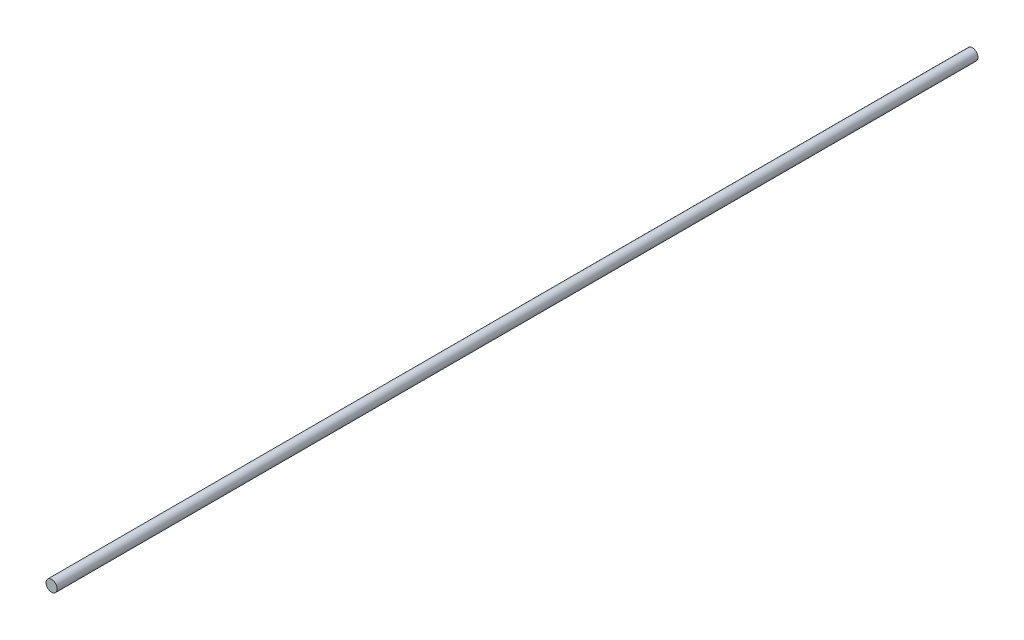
from build123d import *

# Parameters (mm, degrees)
SKETCH1_R           = 30
BOSS_EXTRUDE1_DEPTH = 4950


with BuildPart() as part:
    # Sketch1 → Boss-Extrude1 (new body)
    with BuildSketch(Plane.XY):
        Circle(SKETCH1_R)
    extrude(amount=-BOSS_EXTRUDE1_DEPTH)


solid = part.part
